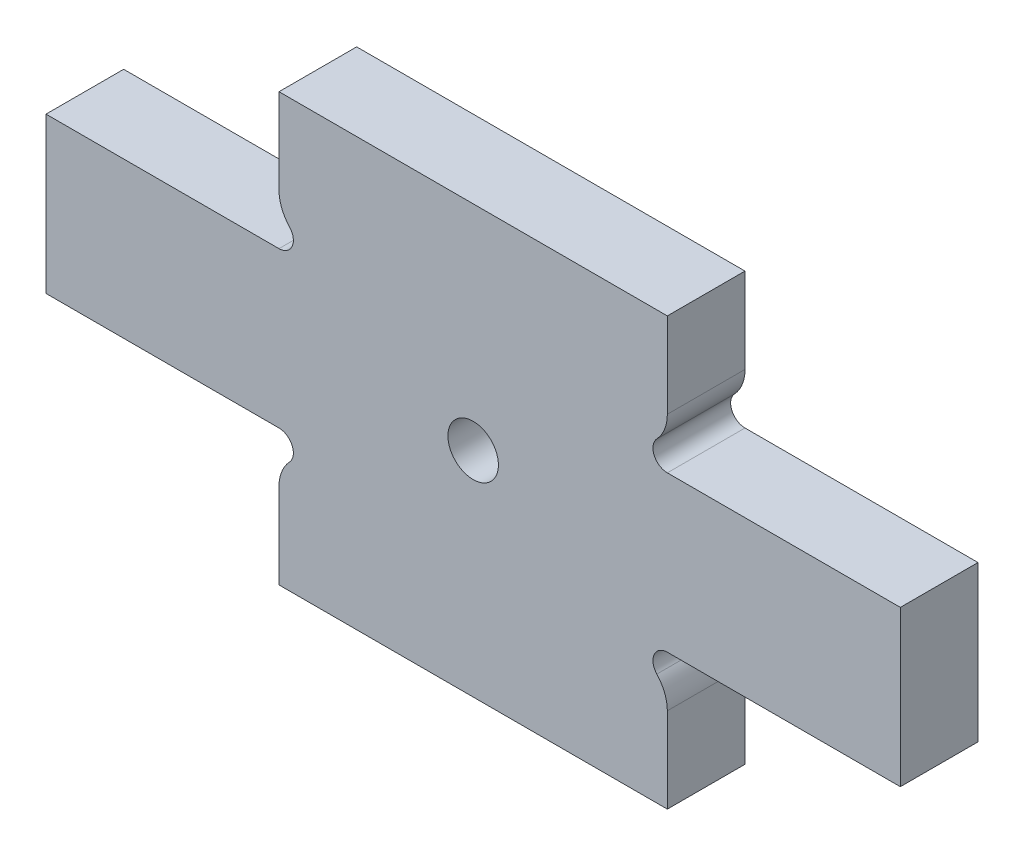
from build123d import *

# Parameters (mm, degrees)
BOSS_EXTRU_1_DEPTH      = 10
ESQUISSE2_R             = 3.25
ENL_V_MAT_EXTRU_1_DEPTH = 10


with BuildPart() as part:
    # Esquisse1 → Boss.-Extru.1 (new body)
    with BuildSketch(Plane.XY):
        with BuildLine():
            Line((25, -10), (55, -10))
            Line((55, -10), (55, 10))
            Line((55, 10), (25, 10))
            ThreePointArc((25, 10), (23.302669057, 11.114087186), (23.649635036, 13.114521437))
            ThreePointArc((23.649635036, 13.114521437), (24.650170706, 14.694781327), (25, 16.532146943))
            Line((25, 16.532146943), (25, 27.5))
            Line((25, 27.5), (-25, 27.5))
            Line((-25, 27.5), (-25, 16.532146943))
            ThreePointArc((-25, 16.532146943), (-24.650170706, 14.694781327), (-23.649635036, 13.114521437))
            ThreePointArc((-23.649635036, 13.114521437), (-23.302669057, 11.114087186), (-25, 10))
            Line((-25, 10), (-55, 10))
            Line((-55, 10), (-55, -10))
            Line((-55, -10), (-25, -10))
            ThreePointArc((-25, -10), (-23.302669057, -11.114087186), (-23.649635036, -13.114521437))
            ThreePointArc((-23.649635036, -13.114521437), (-24.650170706, -14.694781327), (-25, -16.532146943))
            Line((-25, -16.532146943), (-25, -27.5))
            Line((-25, -27.5), (25, -27.5))
            Line((25, -27.5), (25, -16.532146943))
            ThreePointArc((25, -16.532146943), (24.650170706, -14.694781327), (23.649635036, -13.114521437))
            ThreePointArc((23.649635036, -13.114521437), (23.302669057, -11.114087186), (25, -10))
        make_face()
    extrude(amount=BOSS_EXTRU_1_DEPTH)

    # Esquisse2 → Enl_v. mat.-Extru.1 (cut)
    with BuildSketch(Plane.XY.offset(10)):
        Circle(ESQUISSE2_R)
    extrude(amount=-ENL_V_MAT_EXTRU_1_DEPTH, mode=Mode.SUBTRACT)


solid = part.part
